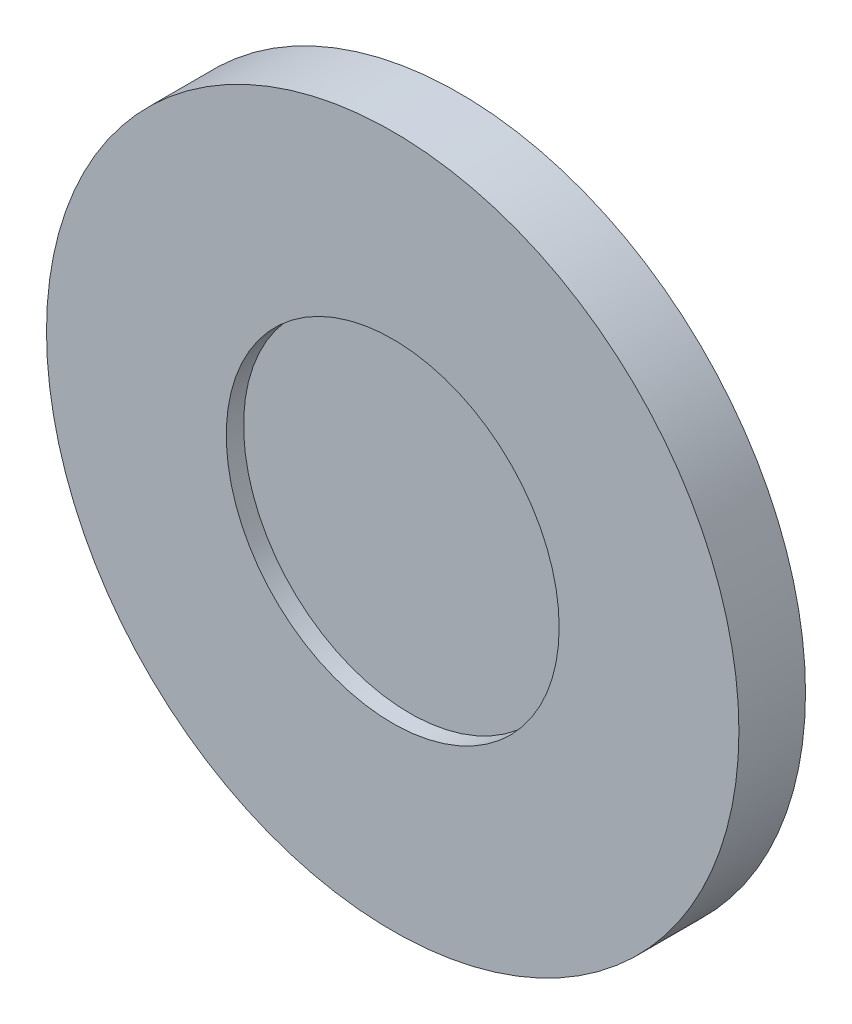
from build123d import *

# Parameters (mm, degrees)
SKETCH_1_R              = 52
F_01_DISC_D104_DEPTH    = 10
F_02_FOOT_1_DEPTH       = 1.2
F_02_FOOT_2_DEPTH       = 1.2
F_02_FOOT_3_DEPTH       = 1.2
SKETCH_5_R              = 25
F_03_RECESS_D50_DEPTH   = 2.6
SKETCH_6_R              = 3.25
F_04_SCREW_SEAT_1_DEPTH = 0.3
SKETCH_7_W              = 6.5
SKETCH_7_H              = 0.7
F_04_SCREW_X_1_1_DEPTH  = 0.45
SKETCH_8_W              = 0.7
SKETCH_8_H              = 6.5
F_04_SCREW_X_1_2_DEPTH  = 0.45
SKETCH_9_R              = 3.25
F_04_SCREW_SEAT_2_DEPTH = 0.3
SKETCH_10_W             = 6.5
SKETCH_10_H             = 0.7
F_04_SCREW_X_2_1_DEPTH  = 0.45
SKETCH_11_W             = 0.7
SKETCH_11_H             = 6.5
F_04_SCREW_X_2_2_DEPTH  = 0.45
SKETCH_12_R             = 3.25
F_04_SCREW_SEAT_3_DEPTH = 0.3
SKETCH_13_W             = 6.5
SKETCH_13_H             = 0.7
F_04_SCREW_X_3_1_DEPTH  = 0.45
SKETCH_14_W             = 0.7
SKETCH_14_H             = 6.5
F_04_SCREW_X_3_2_DEPTH  = 0.45


with BuildPart() as part:
    # Sketch 1 → 01_DISC_D104 (new body)
    with BuildSketch(Plane.XY):
        Circle(SKETCH_1_R)
    extrude(amount=F_01_DISC_D104_DEPTH)

    # Sketch 2 → 02_FOOT_1 (add)
    with BuildSketch(Plane.XY):
        with BuildLine():
            Line((27.984398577, 37.136551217), (23.470785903, 31.146784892))
            ThreePointArc((23.470785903, 31.146784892), (33.774990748, 19.5), (38.709299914, 4.752904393))
            Line((38.709299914, 4.752904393), (46.153396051, 5.666924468))
            ThreePointArc((46.153396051, 5.666924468), (40.270181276, 23.25), (27.984398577, 37.136551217))
        make_face()
    extrude(amount=-F_02_FOOT_1_DEPTH)

    # Sketch 3 → 02_FOOT_2 (add)
    with BuildSketch(Plane.XY):
        with BuildLine():
            Line((-46.153396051, 5.666924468), (-38.709299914, 4.752904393))
            ThreePointArc((-38.709299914, 4.752904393), (-33.774990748, 19.5), (-23.470785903, 31.146784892))
            Line((-23.470785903, 31.146784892), (-27.984398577, 37.136551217))
            ThreePointArc((-27.984398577, 37.136551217), (-40.270181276, 23.25), (-46.153396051, 5.666924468))
        make_face()
    extrude(amount=-F_02_FOOT_2_DEPTH)

    # Sketch 4 → 02_FOOT_3 (add)
    with BuildSketch(Plane.XY):
        with BuildLine():
            Line((18.168997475, -42.803475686), (15.238514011, -35.899689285))
            ThreePointArc((15.238514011, -35.899689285), (0, -39), (-15.238514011, -35.899689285))
            Line((-15.238514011, -35.899689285), (-18.168997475, -42.803475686))
            ThreePointArc((-18.168997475, -42.803475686), (0, -46.5), (18.168997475, -42.803475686))
        make_face()
    extrude(amount=-F_02_FOOT_3_DEPTH)

    # Sketch 5 → 03_RECESS_D50 (cut)
    with BuildSketch(Plane.XY.offset(10)):
        Circle(SKETCH_5_R)
    extrude(amount=-F_03_RECESS_D50_DEPTH, mode=Mode.SUBTRACT)

    # Sketch 6 → 04_SCREW_SEAT_1 (cut)
    with BuildSketch(Plane.XY):
        with Locations((0, 12)):
            Circle(SKETCH_6_R)
    extrude(amount=F_04_SCREW_SEAT_1_DEPTH, mode=Mode.SUBTRACT)

    # Sketch 7 → 04_SCREW_X_1_1 (cut)
    with BuildSketch(Plane.XY):
        with Locations((0, 12)):
            Rectangle(SKETCH_7_W, SKETCH_7_H)
    extrude(amount=F_04_SCREW_X_1_1_DEPTH, mode=Mode.SUBTRACT)

    # Sketch 8 → 04_SCREW_X_1_2 (cut)
    with BuildSketch(Plane.XY):
        with Locations((0, 12)):
            Rectangle(SKETCH_8_W, SKETCH_8_H)
    extrude(amount=F_04_SCREW_X_1_2_DEPTH, mode=Mode.SUBTRACT)

    # Sketch 9 → 04_SCREW_SEAT_2 (cut)
    with BuildSketch(Plane.XY):
        with Locations((-10.392304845, -6)):
            Circle(SKETCH_9_R)
    extrude(amount=F_04_SCREW_SEAT_2_DEPTH, mode=Mode.SUBTRACT)

    # Sketch 10 → 04_SCREW_X_2_1 (cut)
    with BuildSketch(Plane.XY):
        with Locations((-10.392304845, -6)):
            Rectangle(SKETCH_10_W, SKETCH_10_H)
    extrude(amount=F_04_SCREW_X_2_1_DEPTH, mode=Mode.SUBTRACT)

    # Sketch 11 → 04_SCREW_X_2_2 (cut)
    with BuildSketch(Plane.XY):
        with Locations((-10.392304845, -6)):
            Rectangle(SKETCH_11_W, SKETCH_11_H)
    extrude(amount=F_04_SCREW_X_2_2_DEPTH, mode=Mode.SUBTRACT)

    # Sketch 12 → 04_SCREW_SEAT_3 (cut)
    with BuildSketch(Plane.XY):
        with Locations((10.392304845, -6)):
            Circle(SKETCH_12_R)
    extrude(amount=F_04_SCREW_SEAT_3_DEPTH, mode=Mode.SUBTRACT)

    # Sketch 13 → 04_SCREW_X_3_1 (cut)
    with BuildSketch(Plane.XY):
        with Locations((10.392304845, -6)):
            Rectangle(SKETCH_13_W, SKETCH_13_H)
    extrude(amount=F_04_SCREW_X_3_1_DEPTH, mode=Mode.SUBTRACT)

    # Sketch 14 → 04_SCREW_X_3_2 (cut)
    with BuildSketch(Plane.XY):
        with Locations((10.392304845, -6)):
            Rectangle(SKETCH_14_W, SKETCH_14_H)
    extrude(amount=F_04_SCREW_X_3_2_DEPTH, mode=Mode.SUBTRACT)


solid = part.part
